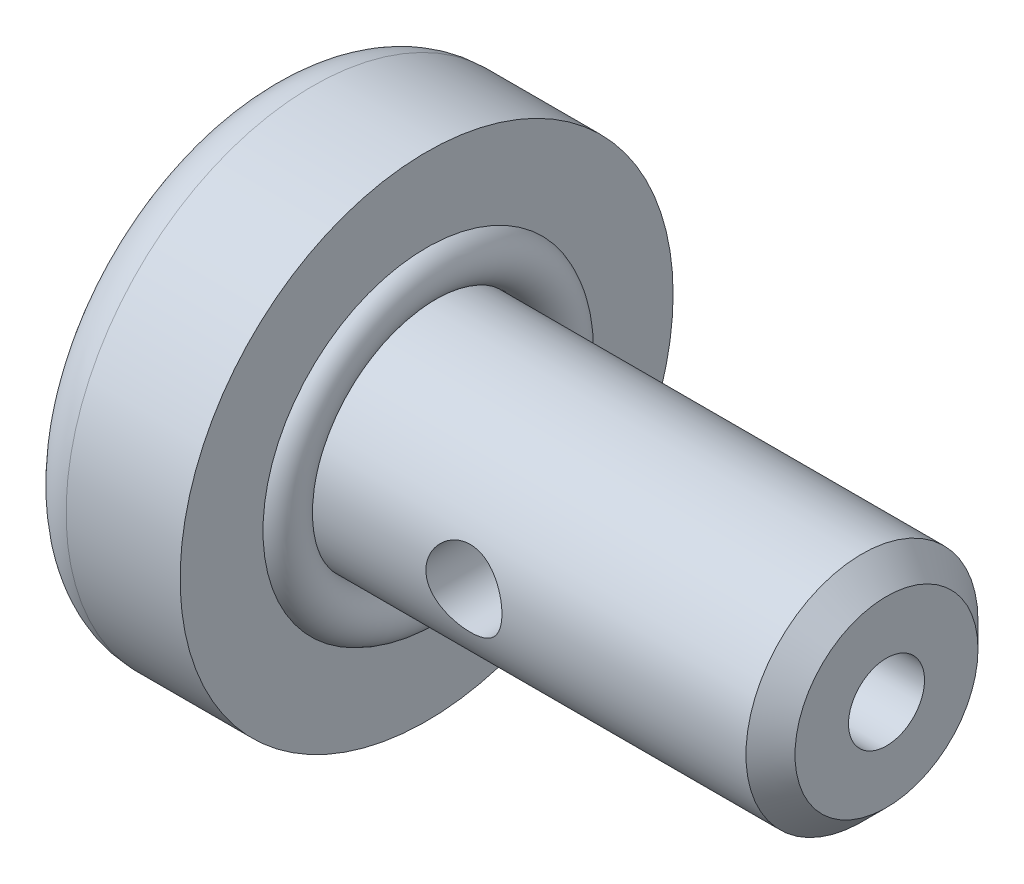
from build123d import *

# Parameters (mm, degrees)
CHAMFER1_SIZE           = 0.508
CUT_EXTRUDE1_DEPTH      = 15.785898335
CUT_EXTRUDE1_DEPTH_BACK = 15.785898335
SKETCH2_R               = 0.7874
CUT_EXTRUDE2_DEPTH      = 3.175


with BuildPart() as part:
    # Sketch1 → Base-Revolve (revolve)
    with BuildSketch(Plane.XY, mode=Mode.PRIVATE) as base_revolve_sk:
        with BuildLine():
            Line((0, 0), (4.830921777, 0))
            Line((4.830921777, 0), (5.2832, 0.7874))
            Line((5.2832, 0.7874), (12.9032, 0.7874))
            Line((12.9032, 0.7874), (12.9032, 2.403328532))
            Line((12.9032, 2.403328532), (3.205880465, 2.403328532))
            ThreePointArc((3.205880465, 2.403328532), (3.706293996, 2.823862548), (3.3782, 3.389209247))
            Line((3.3782, 3.389209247), (3.3782, 5.1054))
            Line((3.3782, 5.1054), (1.016, 5.1054))
            ThreePointArc((1.016, 5.1054), (0.29757951, 4.80782049), (0, 4.0894))
            Line((0, 4.0894), (0, 0))
        make_face()
    revolve(base_revolve_sk.sketch.rotate(Axis((0, 0, 0), (-1, 0, 0)), 90), axis=Axis((0, 0, 0), (-1, 0, 0)))

    # Chamfer1
    chamfer1_edges = [part.edges().sort_by_distance(p)[0] for p in [
        (12.9032, 0, 2.403328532),
    ]]
    chamfer(chamfer1_edges, length=CHAMFER1_SIZE)

    # Sketch2 → Cut-Extrude1 (cut, two sides: drawn at the far end of the back side and taken through both)
    with BuildSketch(Plane.XY.offset(-CUT_EXTRUDE1_DEPTH_BACK)):
        with Locations((6.5532, 0)):
            Circle(SKETCH2_R)
    extrude(amount=CUT_EXTRUDE1_DEPTH + CUT_EXTRUDE1_DEPTH_BACK, mode=Mode.SUBTRACT)

    # Hexagon - circumscribed2 → Cut-Extrude2 (cut)
    with BuildSketch(Plane(origin=(0, -0.328288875, -0.244470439), x_dir=(0, 0, 1), z_dir=(-1, 0, 0))):
        Polygon((-0.672073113, 1.915788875), (1.161013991, 1.915788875), (2.077557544, 0.328288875), (1.161013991, -1.259211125), (-0.672073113, -1.259211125), (-1.588616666, 0.328288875), align=None)
    extrude(amount=-CUT_EXTRUDE2_DEPTH, mode=Mode.SUBTRACT)


solid = part.part
